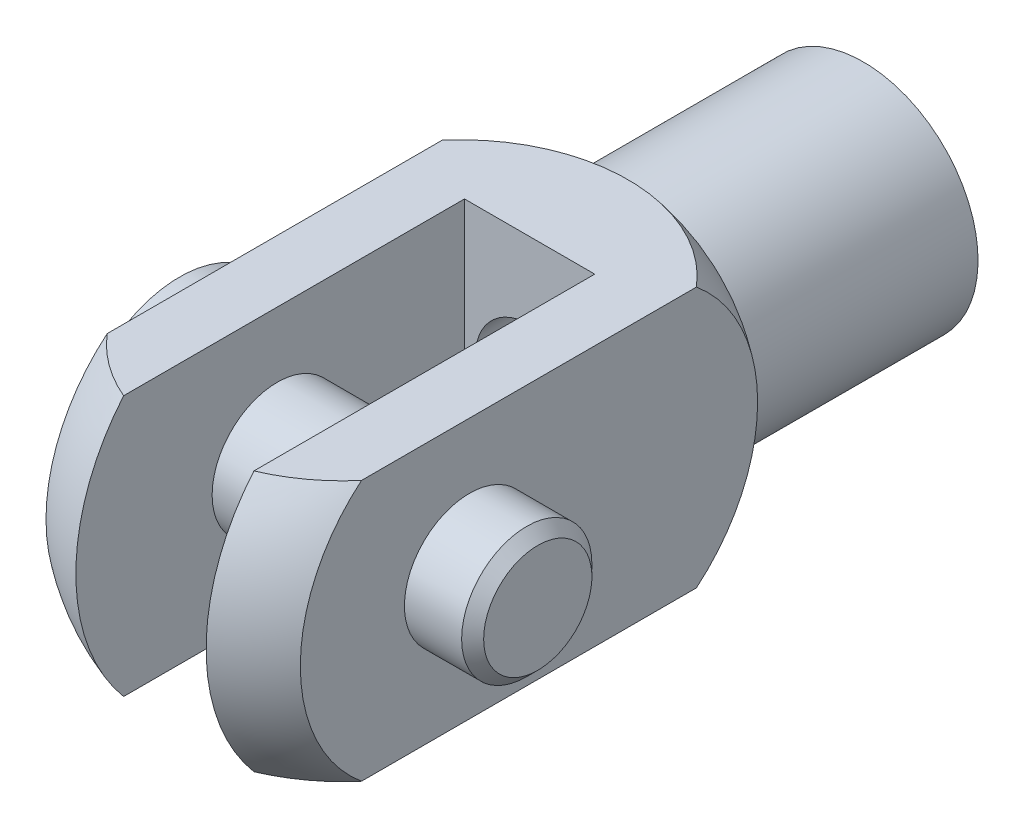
ISO-10303-21;
HEADER;
FILE_DESCRIPTION(('STEP AP214'),'2;1');
FILE_NAME('part.step','',(''),(''),'','','');
FILE_SCHEMA(('AUTOMOTIVE_DESIGN { 1 0 10303 214 1 1 1 1 }'));
ENDSEC;
DATA;
#1=APPLICATION_CONTEXT('core data for automotive mechanical design processes');
#2=APPLICATION_PROTOCOL_DEFINITION('international standard','automotive_design',2000,#1);
#3=PRODUCT_CONTEXT('',#1,'mechanical');
#4=PRODUCT('Part','Part','',(#3));
#5=PRODUCT_RELATED_PRODUCT_CATEGORY('part','',(#4));
#6=PRODUCT_DEFINITION_FORMATION('','',#4);
#7=PRODUCT_DEFINITION_CONTEXT('part definition',#1,'design');
#8=PRODUCT_DEFINITION('design','',#6,#7);
#9=PRODUCT_DEFINITION_SHAPE('','',#8);
#10=(LENGTH_UNIT() NAMED_UNIT(*) SI_UNIT(.MILLI.,.METRE.));
#11=(NAMED_UNIT(*) PLANE_ANGLE_UNIT() SI_UNIT($,.RADIAN.));
#12=(NAMED_UNIT(*) SI_UNIT($,.STERADIAN.) SOLID_ANGLE_UNIT());
#13=UNCERTAINTY_MEASURE_WITH_UNIT(LENGTH_MEASURE(1.E-05),#10,'distance_accuracy_value','');
#14=(GEOMETRIC_REPRESENTATION_CONTEXT(3) GLOBAL_UNCERTAINTY_ASSIGNED_CONTEXT((#13)) GLOBAL_UNIT_ASSIGNED_CONTEXT((#10,
#11,#12)) REPRESENTATION_CONTEXT('',''));
#15=CARTESIAN_POINT('',(0.,0.,0.));
#16=DIRECTION('',(0.,0.,1.));
#17=DIRECTION('',(1.,0.,0.));
#18=AXIS2_PLACEMENT_3D('',#15,#16,#17);
#19=CARTESIAN_POINT('',(0.,0.,0.));
#20=DIRECTION('',(0.,0.,-1.));
#21=DIRECTION('',(-1.,0.,0.));
#22=AXIS2_PLACEMENT_3D('',#19,#20,#21);
#23=PLANE('',#22);
#24=CARTESIAN_POINT('',(0.,0.,0.));
#25=DIRECTION('',(0.,0.,1.));
#26=DIRECTION('',(0.,-1.,0.));
#27=AXIS2_PLACEMENT_3D('',#24,#25,#26);
#28=CIRCLE('',#27,7.04);
#29=CARTESIAN_POINT('',(0.,-7.04,0.));
#30=VERTEX_POINT('',#29);
#31=EDGE_CURVE('E128',#30,#30,#28,.T.);
#32=ORIENTED_EDGE('',*,*,#31,.F.);
#33=EDGE_LOOP('',(#32));
#34=FACE_BOUND('',#33,.T.);
#35=CARTESIAN_POINT('',(0.,0.,0.));
#36=DIRECTION('',(0.,0.,1.));
#37=DIRECTION('',(1.,0.,0.));
#38=AXIS2_PLACEMENT_3D('',#35,#36,#37);
#39=CIRCLE('',#38,4.);
#40=CARTESIAN_POINT('',(4.,0.,0.));
#41=VERTEX_POINT('',#40);
#42=EDGE_CURVE('E454',#41,#41,#39,.T.);
#43=ORIENTED_EDGE('',*,*,#42,.T.);
#44=EDGE_LOOP('',(#43));
#45=FACE_BOUND('',#44,.T.);
#46=ADVANCED_FACE('F16',(#34,#45),#23,.T.);
#47=CARTESIAN_POINT('',(0.,0.,32.));
#48=DIRECTION('',(1.,0.,0.));
#49=DIRECTION('',(0.,0.,-1.));
#50=AXIS2_PLACEMENT_3D('',#47,#48,#49);
#51=SPHERICAL_SURFACE('',#50,13.);
#52=CARTESIAN_POINT('',(4.,0.,32.));
#53=DIRECTION('',(1.,0.,0.));
#54=DIRECTION('',(0.,0.,-1.));
#55=AXIS2_PLACEMENT_3D('',#52,#53,#54);
#56=CIRCLE('',#55,12.369316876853);
#57=CARTESIAN_POINT('',(4.,-8.,41.4339811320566));
#58=VERTEX_POINT('',#57);
#59=CARTESIAN_POINT('',(4.,8.,41.4339811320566));
#60=VERTEX_POINT('',#59);
#61=EDGE_CURVE('E125',#58,#60,#56,.F.);
#62=ORIENTED_EDGE('',*,*,#61,.F.);
#63=CARTESIAN_POINT('',(0.,-8.,32.));
#64=DIRECTION('',(0.,-1.,0.));
#65=DIRECTION('',(-1.,0.,0.));
#66=AXIS2_PLACEMENT_3D('',#63,#64,#65);
#67=CIRCLE('',#66,10.2469507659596);
#68=CARTESIAN_POINT('',(7.81,-8.,38.6335435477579));
#69=VERTEX_POINT('',#68);
#70=EDGE_CURVE('E171',#58,#69,#67,.F.);
#71=ORIENTED_EDGE('',*,*,#70,.T.);
#72=CARTESIAN_POINT('',(7.81,0.,32.));
#73=DIRECTION('',(1.,0.,0.));
#74=DIRECTION('',(0.,0.,-1.));
#75=AXIS2_PLACEMENT_3D('',#72,#73,#74);
#76=CIRCLE('',#75,10.3924924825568);
#77=CARTESIAN_POINT('',(7.81,8.,38.6335435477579));
#78=VERTEX_POINT('',#77);
#79=EDGE_CURVE('E25',#69,#78,#76,.F.);
#80=ORIENTED_EDGE('',*,*,#79,.T.);
#81=CARTESIAN_POINT('',(0.,8.,32.));
#82=DIRECTION('',(0.,1.,0.));
#83=DIRECTION('',(1.,0.,0.));
#84=AXIS2_PLACEMENT_3D('',#81,#82,#83);
#85=CIRCLE('',#84,10.2469507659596);
#86=EDGE_CURVE('E167',#78,#60,#85,.F.);
#87=ORIENTED_EDGE('',*,*,#86,.T.);
#88=EDGE_LOOP('',(#62,#71,#80,#87));
#89=FACE_BOUND('',#88,.T.);
#90=ADVANCED_FACE('F181',(#89),#51,.T.);
#91=CARTESIAN_POINT('',(-4.,0.,32.));
#92=DIRECTION('',(-1.,0.,0.));
#93=DIRECTION('',(0.,0.,1.));
#94=AXIS2_PLACEMENT_3D('',#91,#92,#93);
#95=CIRCLE('',#94,12.369316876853);
#96=CARTESIAN_POINT('',(-4.,8.,41.4339811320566));
#97=VERTEX_POINT('',#96);
#98=CARTESIAN_POINT('',(-4.,-8.,41.4339811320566));
#99=VERTEX_POINT('',#98);
#100=EDGE_CURVE('E89',#97,#99,#95,.F.);
#101=ORIENTED_EDGE('',*,*,#100,.F.);
#102=CARTESIAN_POINT('',(-7.81,8.,38.6335435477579));
#103=VERTEX_POINT('',#102);
#104=EDGE_CURVE('E166',#97,#103,#85,.F.);
#105=ORIENTED_EDGE('',*,*,#104,.T.);
#106=CARTESIAN_POINT('',(-7.81,0.,32.));
#107=DIRECTION('',(-1.,0.,0.));
#108=DIRECTION('',(0.,0.,1.));
#109=AXIS2_PLACEMENT_3D('',#106,#107,#108);
#110=CIRCLE('',#109,10.3924924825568);
#111=CARTESIAN_POINT('',(-7.81,-8.,38.6335435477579));
#112=VERTEX_POINT('',#111);
#113=EDGE_CURVE('E162',#103,#112,#110,.F.);
#114=ORIENTED_EDGE('',*,*,#113,.T.);
#115=EDGE_CURVE('E172',#112,#99,#67,.F.);
#116=ORIENTED_EDGE('',*,*,#115,.T.);
#117=EDGE_LOOP('',(#101,#105,#114,#116));
#118=FACE_BOUND('',#117,.T.);
#119=ADVANCED_FACE('F18',(#118),#51,.T.);
#120=CARTESIAN_POINT('',(7.81,0.,28.35));
#121=DIRECTION('',(1.,0.,0.));
#122=DIRECTION('',(0.,0.,-1.));
#123=AXIS2_PLACEMENT_3D('',#120,#121,#122);
#124=PLANE('',#123);
#125=CARTESIAN_POINT('',(7.81,0.,32.));
#126=DIRECTION('',(1.,0.,0.));
#127=DIRECTION('',(0.,0.,-1.));
#128=AXIS2_PLACEMENT_3D('',#125,#126,#127);
#129=CIRCLE('',#128,4.);
#130=CARTESIAN_POINT('',(7.81,0.,28.));
#131=VERTEX_POINT('',#130);
#132=EDGE_CURVE('E96',#131,#131,#129,.T.);
#133=ORIENTED_EDGE('',*,*,#132,.F.);
#134=EDGE_LOOP('',(#133));
#135=FACE_BOUND('',#134,.T.);
#136=CARTESIAN_POINT('',(7.81,0.,24.7));
#137=DIRECTION('',(1.,0.,0.));
#138=DIRECTION('',(0.,0.,-1.));
#139=AXIS2_PLACEMENT_3D('',#136,#137,#138);
#140=CIRCLE('',#139,10.3924924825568);
#141=CARTESIAN_POINT('',(7.81,8.,18.0664564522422));
#142=VERTEX_POINT('',#141);
#143=CARTESIAN_POINT('',(7.81,-8.,18.0664564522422));
#144=VERTEX_POINT('',#143);
#145=EDGE_CURVE('E158',#142,#144,#140,.F.);
#146=ORIENTED_EDGE('',*,*,#145,.F.);
#147=DIRECTION('',(0.,0.,-1.));
#148=VECTOR('',#147,1.);
#149=CARTESIAN_POINT('',(7.81,8.,28.35));
#150=LINE('',#149,#148);
#151=EDGE_CURVE('E138',#78,#142,#150,.T.);
#152=ORIENTED_EDGE('',*,*,#151,.F.);
#153=ORIENTED_EDGE('',*,*,#79,.F.);
#154=DIRECTION('',(0.,0.,1.));
#155=VECTOR('',#154,1.);
#156=CARTESIAN_POINT('',(7.81,-8.,28.35));
#157=LINE('',#156,#155);
#158=EDGE_CURVE('E142',#144,#69,#157,.T.);
#159=ORIENTED_EDGE('',*,*,#158,.F.);
#160=EDGE_LOOP('',(#146,#152,#153,#159));
#161=FACE_BOUND('',#160,.T.);
#162=ADVANCED_FACE('F185',(#135,#161),#124,.T.);
#163=CARTESIAN_POINT('',(-7.81,-8.,28.35));
#164=DIRECTION('',(0.,-1.,0.));
#165=DIRECTION('',(-1.,0.,0.));
#166=AXIS2_PLACEMENT_3D('',#163,#164,#165);
#167=PLANE('',#166);
#168=DIRECTION('',(0.,0.,1.));
#169=VECTOR('',#168,1.);
#170=CARTESIAN_POINT('',(4.,-8.,32.75));
#171=LINE('',#170,#169);
#172=CARTESIAN_POINT('',(4.,-8.,20.5));
#173=VERTEX_POINT('',#172);
#174=EDGE_CURVE('E107',#173,#58,#171,.T.);
#175=ORIENTED_EDGE('',*,*,#174,.F.);
#176=DIRECTION('',(1.,0.,0.));
#177=VECTOR('',#176,1.);
#178=CARTESIAN_POINT('',(-4.,-8.,20.5));
#179=LINE('',#178,#177);
#180=CARTESIAN_POINT('',(-4.,-8.,20.5));
#181=VERTEX_POINT('',#180);
#182=EDGE_CURVE('E99',#181,#173,#179,.T.);
#183=ORIENTED_EDGE('',*,*,#182,.F.);
#184=DIRECTION('',(0.,0.,-1.));
#185=VECTOR('',#184,1.);
#186=CARTESIAN_POINT('',(-4.,-8.,32.75));
#187=LINE('',#186,#185);
#188=EDGE_CURVE('E83',#99,#181,#187,.T.);
#189=ORIENTED_EDGE('',*,*,#188,.F.);
#190=ORIENTED_EDGE('',*,*,#115,.F.);
#191=DIRECTION('',(0.,0.,-1.));
#192=VECTOR('',#191,1.);
#193=CARTESIAN_POINT('',(-7.81,-8.,28.35));
#194=LINE('',#193,#192);
#195=CARTESIAN_POINT('',(-7.81,-8.,18.0664564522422));
#196=VERTEX_POINT('',#195);
#197=EDGE_CURVE('E132',#112,#196,#194,.T.);
#198=ORIENTED_EDGE('',*,*,#197,.T.);
#199=CARTESIAN_POINT('',(0.,-8.,24.7));
#200=DIRECTION('',(0.,-1.,0.));
#201=DIRECTION('',(-1.,0.,0.));
#202=AXIS2_PLACEMENT_3D('',#199,#200,#201);
#203=CIRCLE('',#202,10.2469507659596);
#204=EDGE_CURVE('E154',#144,#196,#203,.F.);
#205=ORIENTED_EDGE('',*,*,#204,.F.);
#206=ORIENTED_EDGE('',*,*,#158,.T.);
#207=ORIENTED_EDGE('',*,*,#70,.F.);
#208=EDGE_LOOP('',(#175,#183,#189,#190,#198,#205,#206,#207));
#209=FACE_BOUND('',#208,.T.);
#210=ADVANCED_FACE('F105',(#209),#167,.T.);
#211=CARTESIAN_POINT('',(-7.81,8.,28.35));
#212=DIRECTION('',(0.,1.,0.));
#213=DIRECTION('',(1.,0.,0.));
#214=AXIS2_PLACEMENT_3D('',#211,#212,#213);
#215=PLANE('',#214);
#216=DIRECTION('',(0.,0.,-1.));
#217=VECTOR('',#216,1.);
#218=CARTESIAN_POINT('',(4.,8.,32.75));
#219=LINE('',#218,#217);
#220=CARTESIAN_POINT('',(4.,8.,20.5));
#221=VERTEX_POINT('',#220);
#222=EDGE_CURVE('E119',#60,#221,#219,.T.);
#223=ORIENTED_EDGE('',*,*,#222,.F.);
#224=ORIENTED_EDGE('',*,*,#86,.F.);
#225=ORIENTED_EDGE('',*,*,#151,.T.);
#226=CARTESIAN_POINT('',(0.,8.,24.7));
#227=DIRECTION('',(0.,1.,0.));
#228=DIRECTION('',(1.,0.,0.));
#229=AXIS2_PLACEMENT_3D('',#226,#227,#228);
#230=CIRCLE('',#229,10.2469507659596);
#231=CARTESIAN_POINT('',(-7.81,8.,18.0664564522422));
#232=VERTEX_POINT('',#231);
#233=EDGE_CURVE('E150',#232,#142,#230,.F.);
#234=ORIENTED_EDGE('',*,*,#233,.F.);
#235=DIRECTION('',(0.,0.,1.));
#236=VECTOR('',#235,1.);
#237=CARTESIAN_POINT('',(-7.81,8.,28.35));
#238=LINE('',#237,#236);
#239=EDGE_CURVE('E40',#232,#103,#238,.T.);
#240=ORIENTED_EDGE('',*,*,#239,.T.);
#241=ORIENTED_EDGE('',*,*,#104,.F.);
#242=DIRECTION('',(0.,0.,1.));
#243=VECTOR('',#242,1.);
#244=CARTESIAN_POINT('',(-4.,8.,32.75));
#245=LINE('',#244,#243);
#246=CARTESIAN_POINT('',(-4.,8.,20.5));
#247=VERTEX_POINT('',#246);
#248=EDGE_CURVE('E95',#247,#97,#245,.T.);
#249=ORIENTED_EDGE('',*,*,#248,.F.);
#250=DIRECTION('',(1.,0.,0.));
#251=VECTOR('',#250,1.);
#252=CARTESIAN_POINT('',(-4.,8.,20.5));
#253=LINE('',#252,#251);
#254=EDGE_CURVE('E102',#247,#221,#253,.T.);
#255=ORIENTED_EDGE('',*,*,#254,.T.);
#256=EDGE_LOOP('',(#223,#224,#225,#234,#240,#241,#249,#255));
#257=FACE_BOUND('',#256,.T.);
#258=ADVANCED_FACE('F190',(#257),#215,.T.);
#259=CARTESIAN_POINT('',(-7.81,0.,28.35));
#260=DIRECTION('',(-1.,0.,0.));
#261=DIRECTION('',(0.,0.,1.));
#262=AXIS2_PLACEMENT_3D('',#259,#260,#261);
#263=PLANE('',#262);
#264=CARTESIAN_POINT('',(-7.81,0.,32.));
#265=DIRECTION('',(-1.,0.,0.));
#266=DIRECTION('',(0.,0.,1.));
#267=AXIS2_PLACEMENT_3D('',#264,#265,#266);
#268=CIRCLE('',#267,4.);
#269=CARTESIAN_POINT('',(-7.81,0.,36.));
#270=VERTEX_POINT('',#269);
#271=EDGE_CURVE('E484',#270,#270,#268,.T.);
#272=ORIENTED_EDGE('',*,*,#271,.F.);
#273=EDGE_LOOP('',(#272));
#274=FACE_BOUND('',#273,.T.);
#275=CARTESIAN_POINT('',(-7.81,0.,24.7));
#276=DIRECTION('',(-1.,0.,0.));
#277=DIRECTION('',(0.,0.,1.));
#278=AXIS2_PLACEMENT_3D('',#275,#276,#277);
#279=CIRCLE('',#278,10.3924924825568);
#280=EDGE_CURVE('E146',#196,#232,#279,.F.);
#281=ORIENTED_EDGE('',*,*,#280,.F.);
#282=ORIENTED_EDGE('',*,*,#197,.F.);
#283=ORIENTED_EDGE('',*,*,#113,.F.);
#284=ORIENTED_EDGE('',*,*,#239,.F.);
#285=EDGE_LOOP('',(#281,#282,#283,#284));
#286=FACE_BOUND('',#285,.T.);
#287=ADVANCED_FACE('F217',(#274,#286),#263,.T.);
#288=CARTESIAN_POINT('',(0.,0.,24.7));
#289=DIRECTION('',(1.,0.,0.));
#290=DIRECTION('',(0.,0.,-1.));
#291=AXIS2_PLACEMENT_3D('',#288,#289,#290);
#292=SPHERICAL_SURFACE('',#291,13.);
#293=CARTESIAN_POINT('',(0.,0.,13.7712123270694));
#294=DIRECTION('',(0.,0.,1.));
#295=DIRECTION('',(1.,0.,0.));
#296=AXIS2_PLACEMENT_3D('',#293,#294,#295);
#297=CIRCLE('',#296,7.04);
#298=CARTESIAN_POINT('',(7.04,0.,13.7712123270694));
#299=VERTEX_POINT('',#298);
#300=EDGE_CURVE('E11',#299,#299,#297,.F.);
#301=ORIENTED_EDGE('',*,*,#300,.F.);
#302=EDGE_LOOP('',(#301));
#303=FACE_BOUND('',#302,.T.);
#304=ORIENTED_EDGE('',*,*,#233,.T.);
#305=ORIENTED_EDGE('',*,*,#145,.T.);
#306=ORIENTED_EDGE('',*,*,#204,.T.);
#307=ORIENTED_EDGE('',*,*,#280,.T.);
#308=EDGE_LOOP('',(#304,#305,#306,#307));
#309=FACE_BOUND('',#308,.T.);
#310=ADVANCED_FACE('F187',(#303,#309),#292,.T.);
#311=CARTESIAN_POINT('',(0.,0.,22.5));
#312=DIRECTION('',(0.,0.,-1.));
#313=DIRECTION('',(0.,-1.,0.));
#314=AXIS2_PLACEMENT_3D('',#311,#312,#313);
#315=CYLINDRICAL_SURFACE('',#314,7.04);
#316=ORIENTED_EDGE('',*,*,#300,.T.);
#317=EDGE_LOOP('',(#316));
#318=FACE_BOUND('',#317,.T.);
#319=ORIENTED_EDGE('',*,*,#31,.T.);
#320=EDGE_LOOP('',(#319));
#321=FACE_BOUND('',#320,.T.);
#322=ADVANCED_FACE('F194',(#318,#321),#315,.T.);
#323=CARTESIAN_POINT('',(4.,0.,32.75));
#324=DIRECTION('',(1.,0.,0.));
#325=DIRECTION('',(0.,0.,-1.));
#326=AXIS2_PLACEMENT_3D('',#323,#324,#325);
#327=PLANE('',#326);
#328=CARTESIAN_POINT('',(4.,0.,32.));
#329=DIRECTION('',(1.,0.,0.));
#330=DIRECTION('',(0.,0.,-1.));
#331=AXIS2_PLACEMENT_3D('',#328,#329,#330);
#332=CIRCLE('',#331,4.);
#333=CARTESIAN_POINT('',(4.,0.,28.));
#334=VERTEX_POINT('',#333);
#335=EDGE_CURVE('E461',#334,#334,#332,.T.);
#336=ORIENTED_EDGE('',*,*,#335,.T.);
#337=EDGE_LOOP('',(#336));
#338=FACE_BOUND('',#337,.T.);
#339=ORIENTED_EDGE('',*,*,#61,.T.);
#340=ORIENTED_EDGE('',*,*,#222,.T.);
#341=DIRECTION('',(0.,-1.,0.));
#342=VECTOR('',#341,1.);
#343=CARTESIAN_POINT('',(4.,0.,20.5));
#344=LINE('',#343,#342);
#345=EDGE_CURVE('E32',#221,#173,#344,.T.);
#346=ORIENTED_EDGE('',*,*,#345,.T.);
#347=ORIENTED_EDGE('',*,*,#174,.T.);
#348=EDGE_LOOP('',(#339,#340,#346,#347));
#349=FACE_BOUND('',#348,.T.);
#350=ADVANCED_FACE('F192',(#338,#349),#327,.F.);
#351=CARTESIAN_POINT('',(-4.,0.,32.75));
#352=DIRECTION('',(-1.,0.,0.));
#353=DIRECTION('',(0.,0.,1.));
#354=AXIS2_PLACEMENT_3D('',#351,#352,#353);
#355=PLANE('',#354);
#356=CARTESIAN_POINT('',(-4.,0.,32.));
#357=DIRECTION('',(-1.,0.,0.));
#358=DIRECTION('',(0.,0.,1.));
#359=AXIS2_PLACEMENT_3D('',#356,#357,#358);
#360=CIRCLE('',#359,4.);
#361=CARTESIAN_POINT('',(-4.,0.,36.));
#362=VERTEX_POINT('',#361);
#363=EDGE_CURVE('E430',#362,#362,#360,.T.);
#364=ORIENTED_EDGE('',*,*,#363,.T.);
#365=EDGE_LOOP('',(#364));
#366=FACE_BOUND('',#365,.T.);
#367=ORIENTED_EDGE('',*,*,#100,.T.);
#368=ORIENTED_EDGE('',*,*,#188,.T.);
#369=DIRECTION('',(0.,1.,0.));
#370=VECTOR('',#369,1.);
#371=CARTESIAN_POINT('',(-4.,0.,20.5));
#372=LINE('',#371,#370);
#373=EDGE_CURVE('E86',#181,#247,#372,.T.);
#374=ORIENTED_EDGE('',*,*,#373,.T.);
#375=ORIENTED_EDGE('',*,*,#248,.T.);
#376=EDGE_LOOP('',(#367,#368,#374,#375));
#377=FACE_BOUND('',#376,.T.);
#378=ADVANCED_FACE('F85',(#366,#377),#355,.F.);
#379=CARTESIAN_POINT('',(-4.,0.,20.5));
#380=DIRECTION('',(0.,0.,-1.));
#381=DIRECTION('',(-1.,0.,0.));
#382=AXIS2_PLACEMENT_3D('',#379,#380,#381);
#383=PLANE('',#382);
#384=CARTESIAN_POINT('',(0.,0.,20.5));
#385=DIRECTION('',(0.,0.,-1.));
#386=DIRECTION('',(-1.,0.,0.));
#387=AXIS2_PLACEMENT_3D('',#384,#385,#386);
#388=CIRCLE('',#387,3.3234375);
#389=CARTESIAN_POINT('',(-3.3234375,0.,20.5));
#390=VERTEX_POINT('',#389);
#391=EDGE_CURVE('E455',#390,#390,#388,.T.);
#392=ORIENTED_EDGE('',*,*,#391,.T.);
#393=EDGE_LOOP('',(#392));
#394=FACE_BOUND('',#393,.T.);
#395=ORIENTED_EDGE('',*,*,#373,.F.);
#396=ORIENTED_EDGE('',*,*,#182,.T.);
#397=ORIENTED_EDGE('',*,*,#345,.F.);
#398=ORIENTED_EDGE('',*,*,#254,.F.);
#399=EDGE_LOOP('',(#395,#396,#397,#398));
#400=FACE_BOUND('',#399,.T.);
#401=ADVANCED_FACE('F98',(#394,#400),#383,.F.);
#402=CARTESIAN_POINT('',(0.,0.,0.));
#403=DIRECTION('',(0.,0.,-1.));
#404=DIRECTION('',(-1.,0.,0.));
#405=AXIS2_PLACEMENT_3D('',#402,#403,#404);
#406=CONICAL_SURFACE('',#405,4.,0.785398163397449);
#407=CARTESIAN_POINT('',(0.,0.,0.6765625));
#408=DIRECTION('',(0.,0.,1.));
#409=DIRECTION('',(1.,0.,0.));
#410=AXIS2_PLACEMENT_3D('',#407,#408,#409);
#411=CIRCLE('',#410,3.3234375);
#412=CARTESIAN_POINT('',(3.3234375,0.,0.6765625));
#413=VERTEX_POINT('',#412);
#414=EDGE_CURVE('E451',#413,#413,#411,.T.);
#415=ORIENTED_EDGE('',*,*,#414,.T.);
#416=EDGE_LOOP('',(#415));
#417=FACE_BOUND('',#416,.T.);
#418=ORIENTED_EDGE('',*,*,#42,.F.);
#419=EDGE_LOOP('',(#418));
#420=FACE_BOUND('',#419,.T.);
#421=ADVANCED_FACE('F266',(#417,#420),#406,.F.);
#422=CARTESIAN_POINT('',(0.,0.,16.));
#423=DIRECTION('',(0.,0.,1.));
#424=DIRECTION('',(1.,0.,0.));
#425=AXIS2_PLACEMENT_3D('',#422,#423,#424);
#426=CYLINDRICAL_SURFACE('',#425,3.3234375);
#427=ORIENTED_EDGE('',*,*,#414,.F.);
#428=EDGE_LOOP('',(#427));
#429=FACE_BOUND('',#428,.T.);
#430=ORIENTED_EDGE('',*,*,#391,.F.);
#431=EDGE_LOOP('',(#430));
#432=FACE_BOUND('',#431,.T.);
#433=ADVANCED_FACE('F276',(#429,#432),#426,.F.);
#434=CARTESIAN_POINT('',(-11.,0.,32.));
#435=DIRECTION('',(1.,0.,0.));
#436=DIRECTION('',(0.,1.,0.));
#437=AXIS2_PLACEMENT_3D('',#434,#435,#436);
#438=CYLINDRICAL_SURFACE('',#437,4.);
#439=ORIENTED_EDGE('',*,*,#363,.F.);
#440=EDGE_LOOP('',(#439));
#441=FACE_BOUND('',#440,.T.);
#442=ORIENTED_EDGE('',*,*,#335,.F.);
#443=EDGE_LOOP('',(#442));
#444=FACE_BOUND('',#443,.T.);
#445=ADVANCED_FACE('F287',(#441,#444),#438,.T.);
#446=ORIENTED_EDGE('',*,*,#271,.T.);
#447=EDGE_LOOP('',(#446));
#448=FACE_BOUND('',#447,.T.);
#449=CARTESIAN_POINT('',(-8.,0.,32.));
#450=DIRECTION('',(1.,0.,0.));
#451=DIRECTION('',(0.,0.,-1.));
#452=AXIS2_PLACEMENT_3D('',#449,#450,#451);
#453=CIRCLE('',#452,4.);
#454=CARTESIAN_POINT('',(-8.,0.,28.));
#455=VERTEX_POINT('',#454);
#456=EDGE_CURVE('E422',#455,#455,#453,.F.);
#457=ORIENTED_EDGE('',*,*,#456,.F.);
#458=EDGE_LOOP('',(#457));
#459=FACE_BOUND('',#458,.T.);
#460=ADVANCED_FACE('F298',(#448,#459),#438,.T.);
#461=CARTESIAN_POINT('',(-8.,0.,32.));
#462=DIRECTION('',(-1.,0.,0.));
#463=DIRECTION('',(0.,-1.,0.));
#464=AXIS2_PLACEMENT_3D('',#461,#462,#463);
#465=CYLINDRICAL_SURFACE('',#464,6.6);
#466=CARTESIAN_POINT('',(-10.,0.,32.));
#467=DIRECTION('',(1.,0.,0.));
#468=DIRECTION('',(0.,-1.,0.));
#469=AXIS2_PLACEMENT_3D('',#466,#467,#468);
#470=CIRCLE('',#469,6.6);
#471=CARTESIAN_POINT('',(-10.,-6.6,32.));
#472=VERTEX_POINT('',#471);
#473=EDGE_CURVE('E423',#472,#472,#470,.T.);
#474=ORIENTED_EDGE('',*,*,#473,.T.);
#475=EDGE_LOOP('',(#474));
#476=FACE_BOUND('',#475,.T.);
#477=CARTESIAN_POINT('',(-8.,0.,32.));
#478=DIRECTION('',(-1.,0.,0.));
#479=DIRECTION('',(0.,-1.,0.));
#480=AXIS2_PLACEMENT_3D('',#477,#478,#479);
#481=CIRCLE('',#480,6.6);
#482=CARTESIAN_POINT('',(-8.,-6.6,32.));
#483=VERTEX_POINT('',#482);
#484=EDGE_CURVE('E408',#483,#483,#481,.T.);
#485=ORIENTED_EDGE('',*,*,#484,.T.);
#486=EDGE_LOOP('',(#485));
#487=FACE_BOUND('',#486,.T.);
#488=ADVANCED_FACE('F310',(#476,#487),#465,.T.);
#489=CARTESIAN_POINT('',(-8.,0.,32.));
#490=DIRECTION('',(1.,0.,0.));
#491=DIRECTION('',(0.,0.,-1.));
#492=AXIS2_PLACEMENT_3D('',#489,#490,#491);
#493=PLANE('',#492);
#494=ORIENTED_EDGE('',*,*,#456,.T.);
#495=EDGE_LOOP('',(#494));
#496=FACE_BOUND('',#495,.T.);
#497=ORIENTED_EDGE('',*,*,#484,.F.);
#498=EDGE_LOOP('',(#497));
#499=FACE_BOUND('',#498,.T.);
#500=ADVANCED_FACE('F321',(#496,#499),#493,.T.);
#501=CARTESIAN_POINT('',(-10.,0.,32.));
#502=DIRECTION('',(-1.,0.,0.));
#503=DIRECTION('',(0.,0.,1.));
#504=AXIS2_PLACEMENT_3D('',#501,#502,#503);
#505=PLANE('',#504);
#506=CARTESIAN_POINT('',(-10.,0.,32.));
#507=DIRECTION('',(-1.,0.,0.));
#508=DIRECTION('',(0.,0.,1.));
#509=AXIS2_PLACEMENT_3D('',#506,#507,#508);
#510=CIRCLE('',#509,4.);
#511=CARTESIAN_POINT('',(-10.,0.,36.));
#512=VERTEX_POINT('',#511);
#513=EDGE_CURVE('E427',#512,#512,#510,.F.);
#514=ORIENTED_EDGE('',*,*,#513,.T.);
#515=EDGE_LOOP('',(#514));
#516=FACE_BOUND('',#515,.T.);
#517=ORIENTED_EDGE('',*,*,#473,.F.);
#518=EDGE_LOOP('',(#517));
#519=FACE_BOUND('',#518,.T.);
#520=ADVANCED_FACE('F332',(#516,#519),#505,.T.);
#521=CARTESIAN_POINT('',(0.,0.,32.));
#522=DIRECTION('',(1.,0.,0.));
#523=DIRECTION('',(0.,0.,-1.));
#524=AXIS2_PLACEMENT_3D('',#521,#522,#523);
#525=SPHERICAL_SURFACE('',#524,11.);
#526=CARTESIAN_POINT('',(-10.2469507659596,0.,32.));
#527=DIRECTION('',(1.,0.,0.));
#528=DIRECTION('',(0.,0.,-1.));
#529=AXIS2_PLACEMENT_3D('',#526,#527,#528);
#530=CIRCLE('',#529,4.);
#531=CARTESIAN_POINT('',(-10.2469507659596,0.,28.));
#532=VERTEX_POINT('',#531);
#533=EDGE_CURVE('E419',#532,#532,#530,.T.);
#534=ORIENTED_EDGE('',*,*,#533,.F.);
#535=EDGE_LOOP('',(#534));
#536=FACE_BOUND('',#535,.T.);
#537=ADVANCED_FACE('F343',(#536),#525,.T.);
#538=ORIENTED_EDGE('',*,*,#513,.F.);
#539=EDGE_LOOP('',(#538));
#540=FACE_BOUND('',#539,.T.);
#541=ORIENTED_EDGE('',*,*,#533,.T.);
#542=EDGE_LOOP('',(#541));
#543=FACE_BOUND('',#542,.T.);
#544=ADVANCED_FACE('F312',(#540,#543),#438,.T.);
#545=ORIENTED_EDGE('',*,*,#132,.T.);
#546=EDGE_LOOP('',(#545));
#547=FACE_BOUND('',#546,.T.);
#548=CARTESIAN_POINT('',(11.3234375,0.,32.));
#549=DIRECTION('',(-1.,0.,0.));
#550=DIRECTION('',(0.,0.,1.));
#551=AXIS2_PLACEMENT_3D('',#548,#549,#550);
#552=CIRCLE('',#551,4.);
#553=CARTESIAN_POINT('',(11.3234375,0.,36.));
#554=VERTEX_POINT('',#553);
#555=EDGE_CURVE('E409',#554,#554,#552,.T.);
#556=ORIENTED_EDGE('',*,*,#555,.T.);
#557=EDGE_LOOP('',(#556));
#558=FACE_BOUND('',#557,.T.);
#559=ADVANCED_FACE('F301',(#547,#558),#438,.T.);
#560=CARTESIAN_POINT('',(12.,0.,32.));
#561=DIRECTION('',(-1.,0.,0.));
#562=DIRECTION('',(0.,0.,1.));
#563=AXIS2_PLACEMENT_3D('',#560,#561,#562);
#564=CONICAL_SURFACE('',#563,3.3234375,0.785398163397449);
#565=ORIENTED_EDGE('',*,*,#555,.F.);
#566=EDGE_LOOP('',(#565));
#567=FACE_BOUND('',#566,.T.);
#568=CARTESIAN_POINT('',(12.,0.,32.));
#569=DIRECTION('',(-1.,0.,0.));
#570=DIRECTION('',(0.,0.,1.));
#571=AXIS2_PLACEMENT_3D('',#568,#569,#570);
#572=CIRCLE('',#571,3.3234375);
#573=CARTESIAN_POINT('',(12.,0.,35.3234375));
#574=VERTEX_POINT('',#573);
#575=EDGE_CURVE('E405',#574,#574,#572,.T.);
#576=ORIENTED_EDGE('',*,*,#575,.T.);
#577=EDGE_LOOP('',(#576));
#578=FACE_BOUND('',#577,.T.);
#579=ADVANCED_FACE('F373',(#567,#578),#564,.T.);
#580=CARTESIAN_POINT('',(12.,0.,32.));
#581=DIRECTION('',(1.,0.,0.));
#582=DIRECTION('',(0.,0.,-1.));
#583=AXIS2_PLACEMENT_3D('',#580,#581,#582);
#584=PLANE('',#583);
#585=ORIENTED_EDGE('',*,*,#575,.F.);
#586=EDGE_LOOP('',(#585));
#587=FACE_BOUND('',#586,.T.);
#588=ADVANCED_FACE('F383',(#587),#584,.T.);
#589=CLOSED_SHELL('',(#46,#90,#119,#162,#210,#258,#287,#310,#322,#350,#378,#401,#421,#433,#445,
#460,#488,#500,#520,#537,#544,#559,#579,#588));
#590=MANIFOLD_SOLID_BREP('B1',#589);
#591=ADVANCED_BREP_SHAPE_REPRESENTATION('',(#18,#590),#14);
#592=SHAPE_DEFINITION_REPRESENTATION(#9,#591);
ENDSEC;
END-ISO-10303-21;
